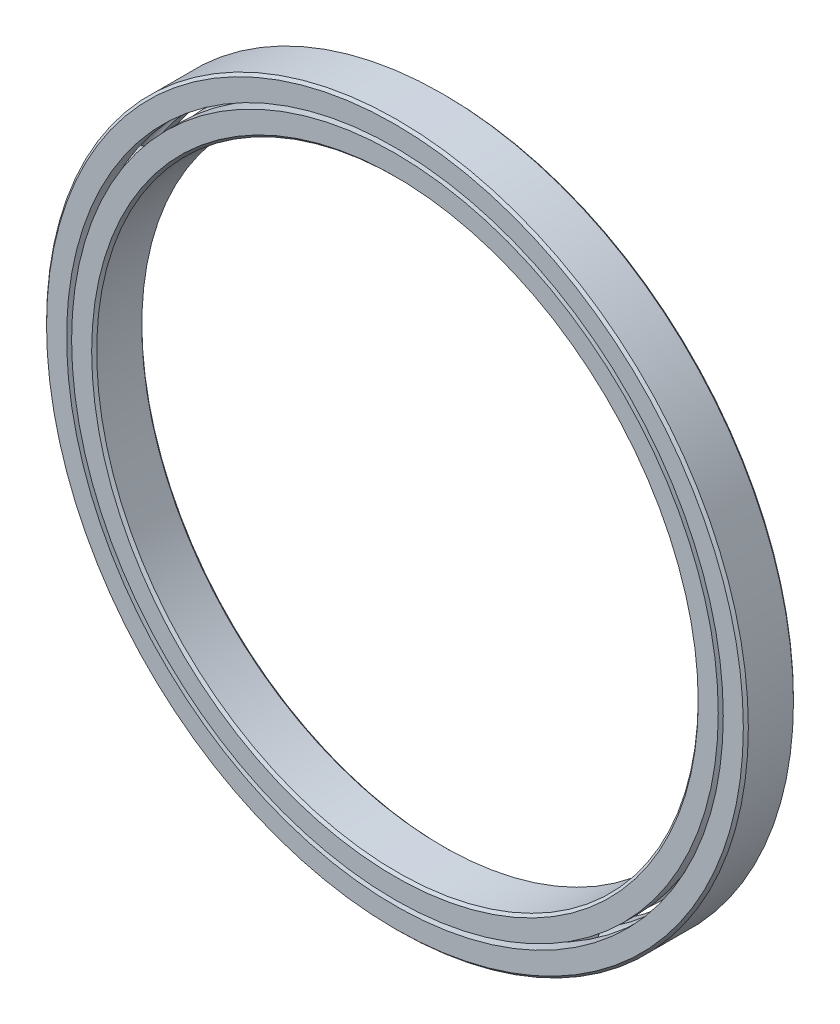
from build123d import *

# Parameters (mm, degrees)
CIRPATTERN1_COUNT = 12


with BuildPart() as part:
    # Sketch1 → Revolve1 (revolve)
    with BuildSketch(Plane(origin=(0, 0, 0), x_dir=(0, 0, -1), z_dir=(1, 0, 0)), mode=Mode.PRIVATE) as revolve1_sk:
        with BuildLine():
            Line((2.8575, 44.45), (-2.8575, 44.45))
            Line((-2.8575, 44.45), (-3.175, 44.1325))
            Line((-3.175, 44.1325), (-3.175, 41.5925))
            Line((-3.175, 41.5925), (-1.411111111, 41.5925))
            ThreePointArc((-1.411111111, 41.5925), (0, 42.721388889), (1.411111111, 41.5925))
            Line((1.411111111, 41.5925), (3.175, 41.5925))
            Line((3.175, 41.5925), (3.175, 44.1325))
            Line((3.175, 44.1325), (2.8575, 44.45))
        make_face()
    revolve(revolve1_sk.sketch.rotate(Axis((0, 0, 3.175), (0, 0, -1)), 90), axis=Axis((0, 0, 3.175), (0, 0, -1)))


with BuildPart() as body_2:
    # Sketch3 → Revolve3 (revolve)
    with BuildSketch(Plane(origin=(0, 0, 0), x_dir=(0, 0, -1), z_dir=(1, 0, 0)), mode=Mode.PRIVATE) as revolve3_sk:
        with BuildLine():
            Line((-3.175, 40.9575), (-1.411111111, 40.9575))
            ThreePointArc((-1.411111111, 40.9575), (0, 39.828611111), (1.411111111, 40.9575))
            Line((1.411111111, 40.9575), (3.175, 40.9575))
            Line((3.175, 40.9575), (3.175, 38.4175))
            Line((3.175, 38.4175), (2.8575, 38.1))
            Line((2.8575, 38.1), (-2.8575, 38.1))
            Line((-2.8575, 38.1), (-3.175, 38.4175))
            Line((-3.175, 38.4175), (-3.175, 40.9575))
        make_face()
    revolve(revolve3_sk.sketch.rotate(Axis((0, 0, 3.175), (0, 0, -1)), 90), axis=Axis((0, 0, 3.175), (0, 0, -1)))


with BuildPart() as body_3:
    # Sketch4 → Revolve4 (revolve)
    with BuildSketch(Plane(origin=(0, 0, 0), x_dir=(0, 0, -1), z_dir=(1, 0, 0))):
        with BuildLine():
            Line((-1.446388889, 41.275), (1.446388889, 41.275))
            ThreePointArc((1.446388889, 41.275), (0, 42.721388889), (-1.446388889, 41.275))
        make_face()
    revolve(axis=Axis((0, 41.275, 1.446388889), (0, 0, -1)))


with BuildPart() as cirpattern1_1:
    # CirPattern1: pattern copy
    add(body_3.part.rotate(Axis((0, 0, 0), (0, 0, 1)), 1 * 360 / CIRPATTERN1_COUNT))


with BuildPart() as cirpattern1_2:
    # CirPattern1: pattern copy
    add(body_3.part.rotate(Axis((0, 0, 0), (0, 0, 1)), 2 * 360 / CIRPATTERN1_COUNT))


with BuildPart() as cirpattern1_3:
    # CirPattern1: pattern copy
    add(body_3.part.rotate(Axis((0, 0, 0), (0, 0, 1)), 3 * 360 / CIRPATTERN1_COUNT))


with BuildPart() as cirpattern1_4:
    # CirPattern1: pattern copy
    add(body_3.part.rotate(Axis((0, 0, 0), (0, 0, 1)), 4 * 360 / CIRPATTERN1_COUNT))


with BuildPart() as cirpattern1_5:
    # CirPattern1: pattern copy
    add(body_3.part.rotate(Axis((0, 0, 0), (0, 0, 1)), 5 * 360 / CIRPATTERN1_COUNT))


with BuildPart() as cirpattern1_6:
    # CirPattern1: pattern copy
    add(body_3.part.rotate(Axis((0, 0, 0), (0, 0, 1)), 6 * 360 / CIRPATTERN1_COUNT))


with BuildPart() as cirpattern1_7:
    # CirPattern1: pattern copy
    add(body_3.part.rotate(Axis((0, 0, 0), (0, 0, 1)), 7 * 360 / CIRPATTERN1_COUNT))


with BuildPart() as cirpattern1_8:
    # CirPattern1: pattern copy
    add(body_3.part.rotate(Axis((0, 0, 0), (0, 0, 1)), 8 * 360 / CIRPATTERN1_COUNT))


with BuildPart() as cirpattern1_9:
    # CirPattern1: pattern copy
    add(body_3.part.rotate(Axis((0, 0, 0), (0, 0, 1)), 9 * 360 / CIRPATTERN1_COUNT))


with BuildPart() as cirpattern1_10:
    # CirPattern1: pattern copy
    add(body_3.part.rotate(Axis((0, 0, 0), (0, 0, 1)), 10 * 360 / CIRPATTERN1_COUNT))


with BuildPart() as cirpattern1_11:
    # CirPattern1: pattern copy
    add(body_3.part.rotate(Axis((0, 0, 0), (0, 0, 1)), 11 * 360 / CIRPATTERN1_COUNT))


solid = Compound([part.part, body_2.part, body_3.part, cirpattern1_1.part, cirpattern1_2.part, cirpattern1_3.part, cirpattern1_4.part, cirpattern1_5.part, cirpattern1_6.part, cirpattern1_7.part, cirpattern1_8.part, cirpattern1_9.part, cirpattern1_10.part, cirpattern1_11.part])
